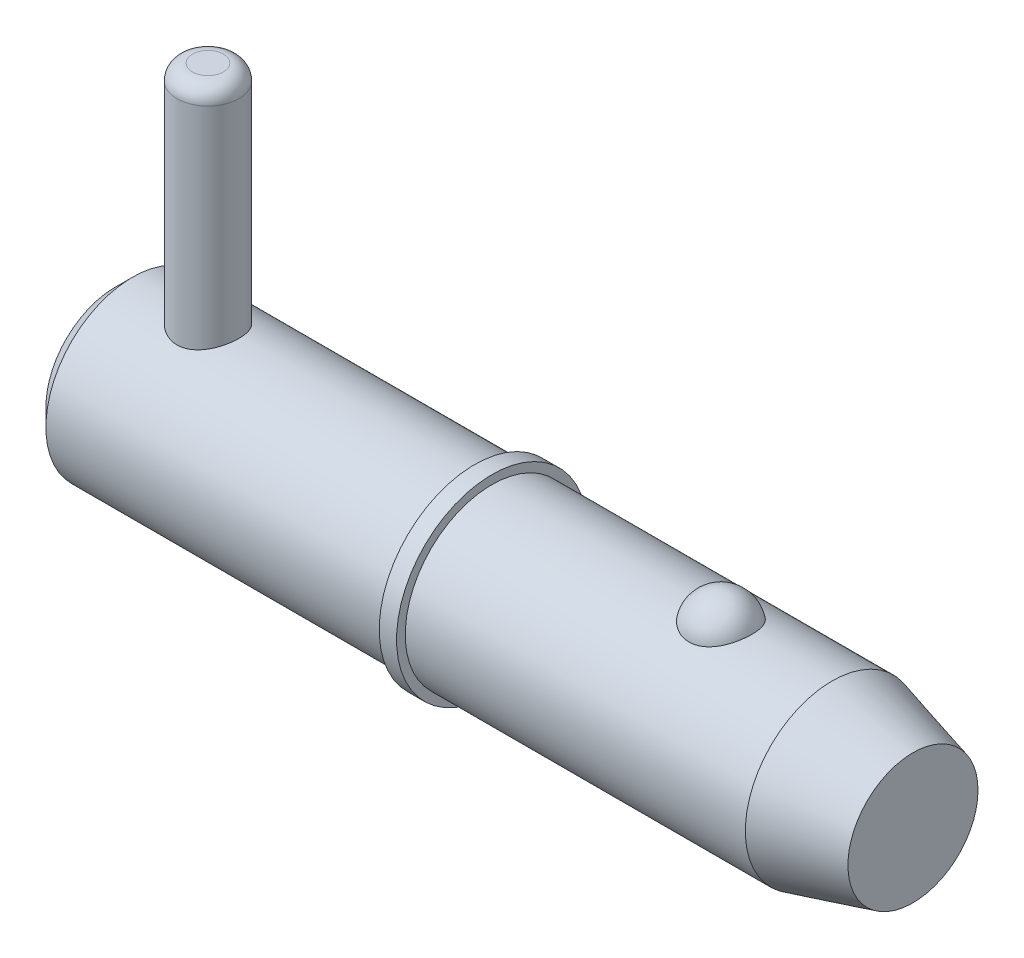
ISO-10303-21;
HEADER;
FILE_DESCRIPTION(('STEP AP214'),'2;1');
FILE_NAME('part.step','',(''),(''),'','','');
FILE_SCHEMA(('AUTOMOTIVE_DESIGN { 1 0 10303 214 1 1 1 1 }'));
ENDSEC;
DATA;
#1=APPLICATION_CONTEXT('core data for automotive mechanical design processes');
#2=APPLICATION_PROTOCOL_DEFINITION('international standard','automotive_design',2000,#1);
#3=PRODUCT_CONTEXT('',#1,'mechanical');
#4=PRODUCT('Part','Part','',(#3));
#5=PRODUCT_RELATED_PRODUCT_CATEGORY('part','',(#4));
#6=PRODUCT_DEFINITION_FORMATION('','',#4);
#7=PRODUCT_DEFINITION_CONTEXT('part definition',#1,'design');
#8=PRODUCT_DEFINITION('design','',#6,#7);
#9=PRODUCT_DEFINITION_SHAPE('','',#8);
#10=(LENGTH_UNIT() NAMED_UNIT(*) SI_UNIT(.MILLI.,.METRE.));
#11=(NAMED_UNIT(*) PLANE_ANGLE_UNIT() SI_UNIT($,.RADIAN.));
#12=(NAMED_UNIT(*) SI_UNIT($,.STERADIAN.) SOLID_ANGLE_UNIT());
#13=UNCERTAINTY_MEASURE_WITH_UNIT(LENGTH_MEASURE(1.E-05),#10,'distance_accuracy_value','');
#14=(GEOMETRIC_REPRESENTATION_CONTEXT(3) GLOBAL_UNCERTAINTY_ASSIGNED_CONTEXT((#13)) GLOBAL_UNIT_ASSIGNED_CONTEXT((#10,
#11,#12)) REPRESENTATION_CONTEXT('',''));
#15=CARTESIAN_POINT('',(0.,0.,0.));
#16=DIRECTION('',(0.,0.,1.));
#17=DIRECTION('',(1.,0.,0.));
#18=AXIS2_PLACEMENT_3D('',#15,#16,#17);
#19=CARTESIAN_POINT('',(5.94,19.845,0.));
#20=DIRECTION('',(0.,-1.,0.));
#21=DIRECTION('',(0.,0.,-1.));
#22=AXIS2_PLACEMENT_3D('',#19,#20,#21);
#23=CYLINDRICAL_SURFACE('',#22,1.98);
#24=CARTESIAN_POINT('',(5.94,-4.565,0.));
#25=DIRECTION('',(0.,1.,0.));
#26=DIRECTION('',(0.,0.,1.));
#27=AXIS2_PLACEMENT_3D('',#24,#25,#26);
#28=CIRCLE('',#27,1.98);
#29=CARTESIAN_POINT('',(5.94,-4.565,1.98));
#30=VERTEX_POINT('',#29);
#31=EDGE_CURVE('P0_E25',#30,#30,#28,.T.);
#32=ORIENTED_EDGE('',*,*,#31,.T.);
#33=EDGE_LOOP('',(#32));
#34=FACE_BOUND('',#33,.T.);
#35=CARTESIAN_POINT('',(5.94,18.855,0.));
#36=DIRECTION('',(0.,1.,0.));
#37=DIRECTION('',(0.,0.,1.));
#38=AXIS2_PLACEMENT_3D('',#35,#36,#37);
#39=CIRCLE('',#38,1.98);
#40=CARTESIAN_POINT('',(5.94,18.855,1.98));
#41=VERTEX_POINT('',#40);
#42=EDGE_CURVE('P0_E29',#41,#41,#39,.F.);
#43=ORIENTED_EDGE('',*,*,#42,.T.);
#44=EDGE_LOOP('',(#43));
#45=FACE_BOUND('',#44,.T.);
#46=ADVANCED_FACE('P0_F14',(#34,#45),#23,.T.);
#47=CARTESIAN_POINT('',(5.94,19.845,0.));
#48=DIRECTION('',(0.,1.,0.));
#49=DIRECTION('',(0.,0.,1.));
#50=AXIS2_PLACEMENT_3D('',#47,#48,#49);
#51=PLANE('',#50);
#52=CARTESIAN_POINT('',(5.94,19.845,0.));
#53=DIRECTION('',(0.,1.,0.));
#54=DIRECTION('',(0.,0.,1.));
#55=AXIS2_PLACEMENT_3D('',#52,#53,#54);
#56=CIRCLE('',#55,0.99);
#57=CARTESIAN_POINT('',(5.94,19.845,0.99));
#58=VERTEX_POINT('',#57);
#59=EDGE_CURVE('P0_E10',#58,#58,#56,.T.);
#60=ORIENTED_EDGE('',*,*,#59,.T.);
#61=EDGE_LOOP('',(#60));
#62=FACE_BOUND('',#61,.T.);
#63=ADVANCED_FACE('P0_F46',(#62),#51,.T.);
#64=CARTESIAN_POINT('',(5.94,-5.555,0.));
#65=DIRECTION('',(0.,1.,0.));
#66=DIRECTION('',(0.,0.,1.));
#67=AXIS2_PLACEMENT_3D('',#64,#65,#66);
#68=PLANE('',#67);
#69=CARTESIAN_POINT('',(5.94,-5.555,0.));
#70=DIRECTION('',(0.,1.,0.));
#71=DIRECTION('',(0.,0.,1.));
#72=AXIS2_PLACEMENT_3D('',#69,#70,#71);
#73=CIRCLE('',#72,0.99);
#74=CARTESIAN_POINT('',(5.94,-5.555,0.99));
#75=VERTEX_POINT('',#74);
#76=EDGE_CURVE('P0_E21',#75,#75,#73,.F.);
#77=ORIENTED_EDGE('',*,*,#76,.T.);
#78=EDGE_LOOP('',(#77));
#79=FACE_BOUND('',#78,.T.);
#80=ADVANCED_FACE('P0_F43',(#79),#68,.F.);
#81=CARTESIAN_POINT('',(5.94,-4.565,0.));
#82=DIRECTION('',(0.,1.,0.));
#83=DIRECTION('',(0.,0.,1.));
#84=AXIS2_PLACEMENT_3D('',#81,#82,#83);
#85=DEGENERATE_TOROIDAL_SURFACE('',#84,0.99,0.99,.T.);
#86=ORIENTED_EDGE('',*,*,#76,.F.);
#87=EDGE_LOOP('',(#86));
#88=FACE_BOUND('',#87,.T.);
#89=ORIENTED_EDGE('',*,*,#31,.F.);
#90=EDGE_LOOP('',(#89));
#91=FACE_BOUND('',#90,.T.);
#92=ADVANCED_FACE('P0_F38',(#88,#91),#85,.T.);
#93=CARTESIAN_POINT('',(5.94,18.855,0.));
#94=DIRECTION('',(0.,1.,0.));
#95=DIRECTION('',(0.,0.,1.));
#96=AXIS2_PLACEMENT_3D('',#93,#94,#95);
#97=DEGENERATE_TOROIDAL_SURFACE('',#96,0.99,0.99,.T.);
#98=ORIENTED_EDGE('',*,*,#42,.F.);
#99=EDGE_LOOP('',(#98));
#100=FACE_BOUND('',#99,.T.);
#101=ORIENTED_EDGE('',*,*,#59,.F.);
#102=EDGE_LOOP('',(#101));
#103=FACE_BOUND('',#102,.T.);
#104=ADVANCED_FACE('P0_F16',(#100,#103),#97,.T.);
#105=CLOSED_SHELL('',(#46,#63,#80,#92,#104));
#106=MANIFOLD_SOLID_BREP('P0_B1',#105);
#107=CARTESIAN_POINT('',(0.,0.,0.));
#108=DIRECTION('',(1.,0.,0.));
#109=DIRECTION('',(0.,0.,-1.));
#110=AXIS2_PLACEMENT_3D('',#107,#108,#109);
#111=CYLINDRICAL_SURFACE('',#110,5.555);
#112=CARTESIAN_POINT('',(45.9171144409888,0.,0.));
#113=DIRECTION('',(1.,0.,0.));
#114=DIRECTION('',(0.,0.,-1.));
#115=AXIS2_PLACEMENT_3D('',#112,#113,#114);
#116=CIRCLE('',#115,5.555);
#117=CARTESIAN_POINT('',(45.9171144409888,0.,-5.555));
#118=VERTEX_POINT('',#117);
#119=EDGE_CURVE('P1_E81',#118,#118,#116,.T.);
#120=ORIENTED_EDGE('',*,*,#119,.F.);
#121=EDGE_LOOP('',(#120));
#122=FACE_BOUND('',#121,.T.);
#123=CARTESIAN_POINT('',(24.13,0.,0.));
#124=DIRECTION('',(1.,0.,0.));
#125=DIRECTION('',(0.,0.,-1.));
#126=AXIS2_PLACEMENT_3D('',#123,#124,#125);
#127=CIRCLE('',#126,5.555);
#128=CARTESIAN_POINT('',(24.13,0.,-5.555));
#129=VERTEX_POINT('',#128);
#130=EDGE_CURVE('P1_E85',#129,#129,#127,.T.);
#131=ORIENTED_EDGE('',*,*,#130,.T.);
#132=EDGE_LOOP('',(#131));
#133=FACE_BOUND('',#132,.T.);
#134=CARTESIAN_POINT('',(38.7986264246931,5.16741224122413,2.03859650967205));
#135=CARTESIAN_POINT('',(38.6929492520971,5.16740893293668,2.03859990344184));
#136=CARTESIAN_POINT('',(38.58729894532,5.17079470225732,2.03008306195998));
#137=CARTESIAN_POINT('',(38.3791419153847,5.18392795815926,1.9963072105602));
#138=CARTESIAN_POINT('',(38.2766344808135,5.19367399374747,1.9710520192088));
#139=CARTESIAN_POINT('',(38.0777710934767,5.21839168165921,1.90463997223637));
#140=CARTESIAN_POINT('',(37.9814064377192,5.23335573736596,1.86350622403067));
#141=CARTESIAN_POINT('',(37.7970804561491,5.26688076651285,1.76652592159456));
#142=CARTESIAN_POINT('',(37.7091207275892,5.28544242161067,1.71067657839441));
#143=CARTESIAN_POINT('',(37.5412654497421,5.32479845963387,1.58399959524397));
#144=CARTESIAN_POINT('',(37.4616656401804,5.34564089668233,1.51279545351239));
#145=CARTESIAN_POINT('',(37.3151290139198,5.38697258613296,1.35828584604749));
#146=CARTESIAN_POINT('',(37.248194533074,5.40746177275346,1.27497815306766));
#147=CARTESIAN_POINT('',(37.1256103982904,5.44694508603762,1.09440293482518));
#148=CARTESIAN_POINT('',(37.0705989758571,5.46583143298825,0.99667783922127));
#149=CARTESIAN_POINT('',(36.9769376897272,5.49908030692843,0.792961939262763));
#150=CARTESIAN_POINT('',(36.9382894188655,5.513442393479,0.686970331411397));
#151=CARTESIAN_POINT('',(36.8776807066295,5.536358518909,0.468019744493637));
#152=CARTESIAN_POINT('',(36.8559725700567,5.54482455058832,0.35498154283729));
#153=CARTESIAN_POINT('',(36.8306362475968,5.55473324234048,0.126595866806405));
#154=CARTESIAN_POINT('',(36.8270077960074,5.55617600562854,0.0112484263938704));
#155=CARTESIAN_POINT('',(36.8378817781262,5.55189984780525,-0.21801161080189));
#156=CARTESIAN_POINT('',(36.8523151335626,5.54620821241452,-0.331928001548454));
#157=CARTESIAN_POINT('',(36.898903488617,5.52828920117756,-0.555544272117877));
#158=CARTESIAN_POINT('',(36.9310588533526,5.5160616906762,-0.665244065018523));
#159=CARTESIAN_POINT('',(37.0124883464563,5.48630779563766,-0.877469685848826));
#160=CARTESIAN_POINT('',(37.0617816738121,5.4687754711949,-0.979987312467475));
#161=CARTESIAN_POINT('',(37.1764785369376,5.43024700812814,-1.1748697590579));
#162=CARTESIAN_POINT('',(37.2418831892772,5.4092506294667,-1.26723387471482));
#163=CARTESIAN_POINT('',(37.3875712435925,5.36600927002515,-1.4394013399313));
#164=CARTESIAN_POINT('',(37.4678859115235,5.34376173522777,-1.51917763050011));
#165=CARTESIAN_POINT('',(37.6414520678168,5.30057971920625,-1.6636033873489));
#166=CARTESIAN_POINT('',(37.734702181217,5.27964509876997,-1.72825445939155));
#167=CARTESIAN_POINT('',(37.9293939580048,5.24205250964,-1.8390947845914));
#168=CARTESIAN_POINT('',(38.0305900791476,5.22530519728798,-1.88568407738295));
#169=CARTESIAN_POINT('',(38.2401552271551,5.19750919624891,-1.96100802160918));
#170=CARTESIAN_POINT('',(38.3485215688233,5.1864583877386,-1.98974931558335));
#171=CARTESIAN_POINT('',(38.5634989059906,5.17184410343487,-2.02742262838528));
#172=CARTESIAN_POINT('',(38.669925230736,5.16793282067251,-2.0372760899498));
#173=CARTESIAN_POINT('',(38.8829925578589,5.1669899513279,-2.03966777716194));
#174=CARTESIAN_POINT('',(38.9896335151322,5.16995704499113,-2.03220932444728));
#175=CARTESIAN_POINT('',(39.1967730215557,5.18222383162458,-2.0007117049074));
#176=CARTESIAN_POINT('',(39.2973599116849,5.19133213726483,-1.97717337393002));
#177=CARTESIAN_POINT('',(39.4930141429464,5.21467637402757,-1.91475248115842));
#178=CARTESIAN_POINT('',(39.5880810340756,5.22891272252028,-1.87586867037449));
#179=CARTESIAN_POINT('',(39.7723711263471,5.26137066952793,-1.78282713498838));
#180=CARTESIAN_POINT('',(39.8614190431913,5.27967329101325,-1.7283512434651));
#181=CARTESIAN_POINT('',(40.0292880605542,5.31817411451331,-1.60597483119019));
#182=CARTESIAN_POINT('',(40.1081068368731,5.33837274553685,-1.53807126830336));
#183=CARTESIAN_POINT('',(40.2575156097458,5.37968287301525,-1.38688970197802));
#184=CARTESIAN_POINT('',(40.3275058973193,5.40079011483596,-1.30301744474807));
#185=CARTESIAN_POINT('',(40.4530125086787,5.44074401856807,-1.12458170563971));
#186=CARTESIAN_POINT('',(40.5085262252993,5.4595902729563,-1.03001630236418));
#187=CARTESIAN_POINT('',(40.6055507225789,5.49369849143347,-0.829439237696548));
#188=CARTESIAN_POINT('',(40.6465483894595,5.50882422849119,-0.723155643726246));
#189=CARTESIAN_POINT('',(40.7111250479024,5.53310911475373,-0.50477271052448));
#190=CARTESIAN_POINT('',(40.7347036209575,5.54226812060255,-0.3926732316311));
#191=CARTESIAN_POINT('',(40.764013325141,5.55370358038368,-0.165459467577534));
#192=CARTESIAN_POINT('',(40.7696884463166,5.55595843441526,-0.0503368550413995));
#193=CARTESIAN_POINT('',(40.762916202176,5.55329317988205,0.179288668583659));
#194=CARTESIAN_POINT('',(40.7504690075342,5.54837313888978,0.293791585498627));
#195=CARTESIAN_POINT('',(40.7077798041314,5.53189037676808,0.518526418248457));
#196=CARTESIAN_POINT('',(40.677598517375,5.5203503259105,0.628771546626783));
#197=CARTESIAN_POINT('',(40.6000962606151,5.49182453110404,0.842318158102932));
#198=CARTESIAN_POINT('',(40.5527743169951,5.47483847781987,0.945619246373));
#199=CARTESIAN_POINT('',(40.4417204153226,5.43710633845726,1.14281571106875));
#200=CARTESIAN_POINT('',(40.3779215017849,5.41634501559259,1.23667048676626));
#201=CARTESIAN_POINT('',(40.2353577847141,5.37334572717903,1.4118524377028));
#202=CARTESIAN_POINT('',(40.1565932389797,5.35110778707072,1.49317982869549));
#203=CARTESIAN_POINT('',(39.9864234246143,5.30779474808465,1.64049162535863));
#204=CARTESIAN_POINT('',(39.8951002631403,5.28671324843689,1.7065687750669));
#205=CARTESIAN_POINT('',(39.7017390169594,5.24804852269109,1.82201372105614));
#206=CARTESIAN_POINT('',(39.5997005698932,5.23046541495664,1.87138095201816));
#207=CARTESIAN_POINT('',(39.3836187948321,5.20042692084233,1.95335298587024));
#208=CARTESIAN_POINT('',(39.269260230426,5.18820192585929,1.98521734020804));
#209=CARTESIAN_POINT('',(39.0361307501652,5.17169804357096,2.02783294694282));
#210=CARTESIAN_POINT('',(38.9173616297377,5.16741595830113,2.03859269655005));
#211=CARTESIAN_POINT('',(38.7986264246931,5.16741224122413,2.03859650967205));
#212=B_SPLINE_CURVE_WITH_KNOTS('',3,(#134,#135,#136,#137,#138,#139,#140,#141,#142,#143,#144,
#145,#146,#147,#148,#149,#150,#151,#152,#153,#154,#155,#156,#157,#158,#159,#160,#161,#162,#163,
#164,#165,#166,#167,#168,#169,#170,#171,#172,#173,#174,#175,#176,#177,#178,#179,#180,#181,#182,
#183,#184,#185,#186,#187,#188,#189,#190,#191,#192,#193,#194,#195,#196,#197,#198,#199,#200,#201,
#202,#203,#204,#205,#206,#207,#208,#209,#210,#211),.UNSPECIFIED.,.T.,.F.,(4,2,2,2,2,2,2,2,2,2,2,
2,2,2,2,2,2,2,2,2,2,2,2,2,2,2,2,2,2,2,2,2,2,2,2,2,2,2,4),(0.,0.316595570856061,
0.633118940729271,0.949183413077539,1.26530783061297,1.59030762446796,1.91536729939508,
2.25495824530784,2.59458224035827,2.93917283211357,3.28375835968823,3.62703002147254,
3.97030875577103,4.31397329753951,4.65766166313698,5.00207904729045,5.34645984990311,
5.6827054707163,6.01882587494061,6.33808403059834,6.65728093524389,6.9669637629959,
7.27667180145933,7.59321535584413,7.90983070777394,8.24210387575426,8.57443684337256,
8.91755896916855,9.26068933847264,9.60489211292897,9.94909164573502,10.2921194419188,
10.6351667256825,10.9796305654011,11.324088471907,11.666392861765,12.0087088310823,
12.3645679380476,12.7202837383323),.UNSPECIFIED.);
#213=CARTESIAN_POINT('',(38.7986264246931,5.16741224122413,2.03859650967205));
#214=VERTEX_POINT('',#213);
#215=EDGE_CURVE('P1_E35',#214,#214,#212,.T.);
#216=ORIENTED_EDGE('',*,*,#215,.T.);
#217=EDGE_LOOP('',(#216));
#218=FACE_BOUND('',#217,.T.);
#219=ADVANCED_FACE('P1_F13',(#122,#133,#218),#111,.T.);
#220=CARTESIAN_POINT('',(0.,0.,0.));
#221=DIRECTION('',(-1.,0.,0.));
#222=DIRECTION('',(0.,0.,1.));
#223=AXIS2_PLACEMENT_3D('',#220,#221,#222);
#224=PLANE('',#223);
#225=CARTESIAN_POINT('',(0.,0.,0.));
#226=DIRECTION('',(1.,0.,0.));
#227=DIRECTION('',(0.,0.,-1.));
#228=AXIS2_PLACEMENT_3D('',#225,#226,#227);
#229=CIRCLE('',#228,4.444);
#230=CARTESIAN_POINT('',(0.,0.,-4.444));
#231=VERTEX_POINT('',#230);
#232=EDGE_CURVE('P1_E9',#231,#231,#229,.T.);
#233=ORIENTED_EDGE('',*,*,#232,.F.);
#234=EDGE_LOOP('',(#233));
#235=FACE_BOUND('',#234,.T.);
#236=ADVANCED_FACE('P1_F15',(#235),#224,.T.);
#237=CARTESIAN_POINT('',(1.111,0.,0.));
#238=DIRECTION('',(1.,0.,0.));
#239=DIRECTION('',(0.,0.,-1.));
#240=AXIS2_PLACEMENT_3D('',#237,#238,#239);
#241=CONICAL_SURFACE('',#240,5.555,0.78539816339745);
#242=ORIENTED_EDGE('',*,*,#232,.T.);
#243=EDGE_LOOP('',(#242));
#244=FACE_BOUND('',#243,.T.);
#245=CARTESIAN_POINT('',(1.111,0.,0.));
#246=DIRECTION('',(1.,0.,0.));
#247=DIRECTION('',(0.,0.,-1.));
#248=AXIS2_PLACEMENT_3D('',#245,#246,#247);
#249=CIRCLE('',#248,5.555);
#250=CARTESIAN_POINT('',(1.111,0.,-5.555));
#251=VERTEX_POINT('',#250);
#252=EDGE_CURVE('P1_E26',#251,#251,#249,.T.);
#253=ORIENTED_EDGE('',*,*,#252,.F.);
#254=EDGE_LOOP('',(#253));
#255=FACE_BOUND('',#254,.T.);
#256=ADVANCED_FACE('P1_F77',(#244,#255),#241,.T.);
#257=CARTESIAN_POINT('',(0.,0.,0.));
#258=DIRECTION('',(1.,0.,0.));
#259=DIRECTION('',(0.,0.,-1.));
#260=AXIS2_PLACEMENT_3D('',#257,#258,#259);
#261=CYLINDRICAL_SURFACE('',#260,5.555);
#262=CARTESIAN_POINT('',(5.94,-5.19014691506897,1.98));
#263=CARTESIAN_POINT('',(5.83264687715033,-5.19014494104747,1.98000226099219));
#264=CARTESIAN_POINT('',(5.7253094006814,-5.19351395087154,1.97123988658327));
#265=CARTESIAN_POINT('',(5.51384517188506,-5.20654291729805,1.93656219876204));
#266=CARTESIAN_POINT('',(5.40971858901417,-5.21620320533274,1.91064598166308));
#267=CARTESIAN_POINT('',(5.20778082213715,-5.24058443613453,1.84271148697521));
#268=CARTESIAN_POINT('',(5.10995634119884,-5.25529427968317,1.80072850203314));
#269=CARTESIAN_POINT('',(4.92270352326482,-5.28810012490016,1.70197537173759));
#270=CARTESIAN_POINT('',(4.83327743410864,-5.3061970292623,1.64520128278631));
#271=CARTESIAN_POINT('',(4.66135184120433,-5.34464714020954,1.51575187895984));
#272=CARTESIAN_POINT('',(4.57928277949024,-5.36506222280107,1.44252311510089));
#273=CARTESIAN_POINT('',(4.42829115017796,-5.40532920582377,1.28342047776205));
#274=CARTESIAN_POINT('',(4.35937105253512,-5.42518099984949,1.19754423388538));
#275=CARTESIAN_POINT('',(4.23461605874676,-5.46281133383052,1.01237205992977));
#276=CARTESIAN_POINT('',(4.17924129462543,-5.48050875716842,0.912748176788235));
#277=CARTESIAN_POINT('',(4.0862117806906,-5.51109938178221,0.70485824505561));
#278=CARTESIAN_POINT('',(4.0485515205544,-5.52399407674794,0.596594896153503));
#279=CARTESIAN_POINT('',(3.99350662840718,-5.54308759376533,0.379019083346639));
#280=CARTESIAN_POINT('',(3.97538263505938,-5.54952987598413,0.269915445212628));
#281=CARTESIAN_POINT('',(3.95756405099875,-5.55586205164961,0.0500378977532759));
#282=CARTESIAN_POINT('',(3.95786404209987,-5.55575387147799,-0.060735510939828));
#283=CARTESIAN_POINT('',(3.97643665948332,-5.54915684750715,-0.275539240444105));
#284=CARTESIAN_POINT('',(3.99390415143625,-5.54295384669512,-0.379649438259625));
#285=CARTESIAN_POINT('',(4.0449721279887,-5.52523170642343,-0.583350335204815));
#286=CARTESIAN_POINT('',(4.07857373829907,-5.51371219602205,-0.682940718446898));
#287=CARTESIAN_POINT('',(4.16137312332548,-5.4863099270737,-0.876423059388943));
#288=CARTESIAN_POINT('',(4.2107826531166,-5.47036834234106,-0.970215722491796));
#289=CARTESIAN_POINT('',(4.32361427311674,-5.43575653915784,-1.1484017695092));
#290=CARTESIAN_POINT('',(4.38704062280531,-5.41708549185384,-1.23279228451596));
#291=CARTESIAN_POINT('',(4.53006791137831,-5.37778429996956,-1.39454579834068));
#292=CARTESIAN_POINT('',(4.61035105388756,-5.35710277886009,-1.4712940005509));
#293=CARTESIAN_POINT('',(4.78279835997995,-5.31692766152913,-1.6104545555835));
#294=CARTESIAN_POINT('',(4.874964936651,-5.29743430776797,-1.67286398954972));
#295=CARTESIAN_POINT('',(5.07076688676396,-5.26153775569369,-1.78259698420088));
#296=CARTESIAN_POINT('',(5.17458163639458,-5.24519780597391,-1.8296227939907));
#297=CARTESIAN_POINT('',(5.38938990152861,-5.21818744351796,-1.90530278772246));
#298=CARTESIAN_POINT('',(5.50037985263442,-5.20751423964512,-1.93396601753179));
#299=CARTESIAN_POINT('',(5.72036376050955,-5.19369176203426,-1.97077654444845));
#300=CARTESIAN_POINT('',(5.82917370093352,-5.19018851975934,-1.97989015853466));
#301=CARTESIAN_POINT('',(6.04680100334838,-5.19010609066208,-1.98010779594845));
#302=CARTESIAN_POINT('',(6.15561835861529,-5.19352540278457,-1.97121572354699));
#303=CARTESIAN_POINT('',(6.36548036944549,-5.20654623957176,-1.93654727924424));
#304=CARTESIAN_POINT('',(6.46666051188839,-5.21588705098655,-1.91148218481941));
#305=CARTESIAN_POINT('',(6.66334537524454,-5.23939939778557,-1.84605494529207));
#306=CARTESIAN_POINT('',(6.75884899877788,-5.25357186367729,-1.8056898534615));
#307=CARTESIAN_POINT('',(6.94517989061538,-5.28576258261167,-1.70921153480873));
#308=CARTESIAN_POINT('',(7.03572661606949,-5.30389804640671,-1.65259670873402));
#309=CARTESIAN_POINT('',(7.20638087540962,-5.34176077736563,-1.52577523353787));
#310=CARTESIAN_POINT('',(7.28648490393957,-5.36148857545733,-1.45556404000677));
#311=CARTESIAN_POINT('',(7.43864697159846,-5.40165494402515,-1.2988614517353));
#312=CARTESIAN_POINT('',(7.50999887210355,-5.42207106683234,-1.21167640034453));
#313=CARTESIAN_POINT('',(7.63712639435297,-5.46023601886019,-1.026066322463));
#314=CARTESIAN_POINT('',(7.69290228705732,-5.47798489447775,-0.927641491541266));
#315=CARTESIAN_POINT('',(7.78684673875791,-5.50876590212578,-0.722633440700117));
#316=CARTESIAN_POINT('',(7.82510508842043,-5.52182201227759,-0.616095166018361));
#317=CARTESIAN_POINT('',(7.88297051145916,-5.54184206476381,-0.397530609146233));
#318=CARTESIAN_POINT('',(7.90258540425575,-5.5488085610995,-0.285506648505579));
#319=CARTESIAN_POINT('',(7.9218262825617,-5.55564472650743,-0.065566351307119));
#320=CARTESIAN_POINT('',(7.92245987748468,-5.55587212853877,0.0422515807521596));
#321=CARTESIAN_POINT('',(7.90626329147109,-5.55011340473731,0.256387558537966));
#322=CARTESIAN_POINT('',(7.88943488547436,-5.54412791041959,0.362705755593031));
#323=CARTESIAN_POINT('',(7.83948457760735,-5.52676548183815,0.568649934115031));
#324=CARTESIAN_POINT('',(7.8067003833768,-5.51550046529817,0.668367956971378));
#325=CARTESIAN_POINT('',(7.72609369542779,-5.48874437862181,0.860911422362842));
#326=CARTESIAN_POINT('',(7.67826838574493,-5.47325251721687,0.953735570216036));
#327=CARTESIAN_POINT('',(7.56675024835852,-5.43884382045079,1.13391068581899));
#328=CARTESIAN_POINT('',(7.50249968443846,-5.41981485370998,1.22089468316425));
#329=CARTESIAN_POINT('',(7.36086495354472,-5.38069275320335,1.38316665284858));
#330=CARTESIAN_POINT('',(7.28347630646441,-5.36059925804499,1.45845061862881));
#331=CARTESIAN_POINT('',(7.11347587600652,-5.32048380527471,1.59876646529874));
#332=CARTESIAN_POINT('',(7.02032386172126,-5.30050854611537,1.66315951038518));
#333=CARTESIAN_POINT('',(6.82388804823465,-5.26398994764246,1.77536801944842));
#334=CARTESIAN_POINT('',(6.7206049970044,-5.24744635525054,1.82318470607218));
#335=CARTESIAN_POINT('',(6.50639706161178,-5.21987969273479,1.90068230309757));
#336=CARTESIAN_POINT('',(6.3954529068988,-5.20887116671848,1.93031547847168));
#337=CARTESIAN_POINT('',(6.16966522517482,-5.19400760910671,1.96996824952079));
#338=CARTESIAN_POINT('',(6.05482366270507,-5.19014902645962,1.97999758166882));
#339=CARTESIAN_POINT('',(5.94,-5.19014691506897,1.98));
#340=B_SPLINE_CURVE_WITH_KNOTS('',3,(#262,#263,#264,#265,#266,#267,#268,#269,#270,#271,#272,
#273,#274,#275,#276,#277,#278,#279,#280,#281,#282,#283,#284,#285,#286,#287,#288,#289,#290,#291,
#292,#293,#294,#295,#296,#297,#298,#299,#300,#301,#302,#303,#304,#305,#306,#307,#308,#309,#310,
#311,#312,#313,#314,#315,#316,#317,#318,#319,#320,#321,#322,#323,#324,#325,#326,#327,#328,#329,
#330,#331,#332,#333,#334,#335,#336,#337,#338,#339),.UNSPECIFIED.,.T.,.F.,(4,2,2,2,2,2,2,2,2,2,2,
2,2,2,2,2,2,2,2,2,2,2,2,2,2,2,2,2,2,2,2,2,2,2,2,2,2,2,4),(0.,0.321632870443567,
0.643282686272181,0.964229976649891,1.28526292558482,1.61937087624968,1.9535415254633,
2.29784481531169,2.64204093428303,2.97269632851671,3.30325448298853,3.61901541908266,
3.93479838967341,4.25500220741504,4.57530346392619,4.91268648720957,5.25013812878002,
5.59378026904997,5.93725299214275,6.26331481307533,6.58930593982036,6.90185604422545,
7.21446637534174,7.53801472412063,7.86167140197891,8.20353561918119,8.54539388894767,
8.88547970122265,9.22542281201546,9.54728637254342,9.86911722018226,10.1844146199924,
10.4997710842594,10.827730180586,11.1558013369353,11.499115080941,11.8424034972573,
12.1865892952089,12.5306041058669),.UNSPECIFIED.);
#341=CARTESIAN_POINT('',(5.94,-5.19014691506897,1.98));
#342=VERTEX_POINT('',#341);
#343=EDGE_CURVE('P1_E17',#342,#342,#340,.T.);
#344=ORIENTED_EDGE('',*,*,#343,.F.);
#345=EDGE_LOOP('',(#344));
#346=FACE_BOUND('',#345,.T.);
#347=CARTESIAN_POINT('',(5.94,5.19014691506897,1.98));
#348=CARTESIAN_POINT('',(6.04735312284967,5.19014494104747,1.98000226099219));
#349=CARTESIAN_POINT('',(6.1546905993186,5.19351395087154,1.97123988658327));
#350=CARTESIAN_POINT('',(6.36615482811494,5.20654291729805,1.93656219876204));
#351=CARTESIAN_POINT('',(6.47028141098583,5.21620320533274,1.91064598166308));
#352=CARTESIAN_POINT('',(6.67221917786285,5.24058443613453,1.84271148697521));
#353=CARTESIAN_POINT('',(6.77004365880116,5.25529427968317,1.80072850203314));
#354=CARTESIAN_POINT('',(6.95729647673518,5.28810012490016,1.70197537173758));
#355=CARTESIAN_POINT('',(7.04672256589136,5.3061970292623,1.64520128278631));
#356=CARTESIAN_POINT('',(7.21864815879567,5.34464714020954,1.51575187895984));
#357=CARTESIAN_POINT('',(7.30071722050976,5.36506222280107,1.44252311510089));
#358=CARTESIAN_POINT('',(7.45170884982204,5.40532920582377,1.28342047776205));
#359=CARTESIAN_POINT('',(7.52062894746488,5.42518099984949,1.19754423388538));
#360=CARTESIAN_POINT('',(7.64538394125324,5.46281133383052,1.01237205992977));
#361=CARTESIAN_POINT('',(7.70075870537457,5.48050875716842,0.912748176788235));
#362=CARTESIAN_POINT('',(7.7937882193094,5.51109938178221,0.704858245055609));
#363=CARTESIAN_POINT('',(7.8314484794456,5.52399407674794,0.596594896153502));
#364=CARTESIAN_POINT('',(7.88649337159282,5.54308759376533,0.379019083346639));
#365=CARTESIAN_POINT('',(7.90461736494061,5.54952987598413,0.269915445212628));
#366=CARTESIAN_POINT('',(7.92243594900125,5.55586205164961,0.0500378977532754));
#367=CARTESIAN_POINT('',(7.92213595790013,5.55575387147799,-0.0607355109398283));
#368=CARTESIAN_POINT('',(7.90356334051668,5.54915684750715,-0.275539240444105));
#369=CARTESIAN_POINT('',(7.88609584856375,5.54295384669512,-0.379649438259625));
#370=CARTESIAN_POINT('',(7.8350278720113,5.52523170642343,-0.583350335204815));
#371=CARTESIAN_POINT('',(7.80142626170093,5.51371219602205,-0.682940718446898));
#372=CARTESIAN_POINT('',(7.71862687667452,5.4863099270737,-0.876423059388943));
#373=CARTESIAN_POINT('',(7.6692173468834,5.47036834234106,-0.970215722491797));
#374=CARTESIAN_POINT('',(7.55638572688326,5.43575653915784,-1.1484017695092));
#375=CARTESIAN_POINT('',(7.49295937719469,5.41708549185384,-1.23279228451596));
#376=CARTESIAN_POINT('',(7.34993208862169,5.37778429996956,-1.39454579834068));
#377=CARTESIAN_POINT('',(7.26964894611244,5.35710277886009,-1.4712940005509));
#378=CARTESIAN_POINT('',(7.09720164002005,5.31692766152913,-1.6104545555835));
#379=CARTESIAN_POINT('',(7.00503506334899,5.29743430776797,-1.67286398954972));
#380=CARTESIAN_POINT('',(6.80923311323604,5.26153775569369,-1.78259698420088));
#381=CARTESIAN_POINT('',(6.70541836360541,5.24519780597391,-1.8296227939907));
#382=CARTESIAN_POINT('',(6.49061009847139,5.21818744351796,-1.90530278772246));
#383=CARTESIAN_POINT('',(6.37962014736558,5.20751423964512,-1.93396601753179));
#384=CARTESIAN_POINT('',(6.15963623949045,5.19369176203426,-1.97077654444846));
#385=CARTESIAN_POINT('',(6.05082629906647,5.19018851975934,-1.97989015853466));
#386=CARTESIAN_POINT('',(5.83319899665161,5.19010609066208,-1.98010779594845));
#387=CARTESIAN_POINT('',(5.7243816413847,5.19352540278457,-1.97121572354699));
#388=CARTESIAN_POINT('',(5.5145196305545,5.20654623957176,-1.93654727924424));
#389=CARTESIAN_POINT('',(5.4133394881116,5.21588705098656,-1.91148218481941));
#390=CARTESIAN_POINT('',(5.21665462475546,5.23939939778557,-1.84605494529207));
#391=CARTESIAN_POINT('',(5.12115100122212,5.25357186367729,-1.8056898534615));
#392=CARTESIAN_POINT('',(4.93482010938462,5.28576258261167,-1.70921153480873));
#393=CARTESIAN_POINT('',(4.84427338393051,5.30389804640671,-1.65259670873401));
#394=CARTESIAN_POINT('',(4.67361912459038,5.34176077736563,-1.52577523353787));
#395=CARTESIAN_POINT('',(4.59351509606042,5.36148857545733,-1.45556404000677));
#396=CARTESIAN_POINT('',(4.44135302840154,5.40165494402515,-1.2988614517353));
#397=CARTESIAN_POINT('',(4.37000112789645,5.42207106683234,-1.21167640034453));
#398=CARTESIAN_POINT('',(4.24287360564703,5.46023601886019,-1.026066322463));
#399=CARTESIAN_POINT('',(4.18709771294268,5.47798489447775,-0.927641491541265));
#400=CARTESIAN_POINT('',(4.09315326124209,5.50876590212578,-0.722633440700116));
#401=CARTESIAN_POINT('',(4.05489491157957,5.52182201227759,-0.61609516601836));
#402=CARTESIAN_POINT('',(3.99702948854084,5.54184206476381,-0.397530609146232));
#403=CARTESIAN_POINT('',(3.97741459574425,5.5488085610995,-0.285506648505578));
#404=CARTESIAN_POINT('',(3.9581737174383,5.55564472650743,-0.0655663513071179));
#405=CARTESIAN_POINT('',(3.95754012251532,5.55587212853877,0.0422515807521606));
#406=CARTESIAN_POINT('',(3.97373670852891,5.55011340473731,0.256387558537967));
#407=CARTESIAN_POINT('',(3.99056511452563,5.54412791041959,0.362705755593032));
#408=CARTESIAN_POINT('',(4.04051542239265,5.52676548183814,0.568649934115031));
#409=CARTESIAN_POINT('',(4.07329961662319,5.51550046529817,0.668367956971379));
#410=CARTESIAN_POINT('',(4.15390630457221,5.48874437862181,0.860911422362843));
#411=CARTESIAN_POINT('',(4.20173161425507,5.47325251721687,0.953735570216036));
#412=CARTESIAN_POINT('',(4.31324975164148,5.43884382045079,1.13391068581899));
#413=CARTESIAN_POINT('',(4.37750031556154,5.41981485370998,1.22089468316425));
#414=CARTESIAN_POINT('',(4.51913504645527,5.38069275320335,1.38316665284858));
#415=CARTESIAN_POINT('',(4.59652369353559,5.36059925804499,1.45845061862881));
#416=CARTESIAN_POINT('',(4.76652412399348,5.32048380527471,1.59876646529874));
#417=CARTESIAN_POINT('',(4.85967613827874,5.30050854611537,1.66315951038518));
#418=CARTESIAN_POINT('',(5.05611195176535,5.26398994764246,1.77536801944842));
#419=CARTESIAN_POINT('',(5.1593950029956,5.24744635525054,1.82318470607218));
#420=CARTESIAN_POINT('',(5.37360293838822,5.21987969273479,1.90068230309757));
#421=CARTESIAN_POINT('',(5.4845470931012,5.20887116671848,1.93031547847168));
#422=CARTESIAN_POINT('',(5.71033477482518,5.19400760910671,1.96996824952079));
#423=CARTESIAN_POINT('',(5.82517633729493,5.19014902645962,1.97999758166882));
#424=CARTESIAN_POINT('',(5.94,5.19014691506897,1.98));
#425=B_SPLINE_CURVE_WITH_KNOTS('',3,(#347,#348,#349,#350,#351,#352,#353,#354,#355,#356,#357,
#358,#359,#360,#361,#362,#363,#364,#365,#366,#367,#368,#369,#370,#371,#372,#373,#374,#375,#376,
#377,#378,#379,#380,#381,#382,#383,#384,#385,#386,#387,#388,#389,#390,#391,#392,#393,#394,#395,
#396,#397,#398,#399,#400,#401,#402,#403,#404,#405,#406,#407,#408,#409,#410,#411,#412,#413,#414,
#415,#416,#417,#418,#419,#420,#421,#422,#423,#424),.UNSPECIFIED.,.T.,.F.,(4,2,2,2,2,2,2,2,2,2,2,
2,2,2,2,2,2,2,2,2,2,2,2,2,2,2,2,2,2,2,2,2,2,2,2,2,2,2,4),(0.,0.321632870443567,
0.643282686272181,0.964229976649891,1.28526292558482,1.61937087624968,1.9535415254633,
2.29784481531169,2.64204093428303,2.97269632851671,3.30325448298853,3.61901541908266,
3.93479838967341,4.25500220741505,4.57530346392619,4.91268648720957,5.25013812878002,
5.59378026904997,5.93725299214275,6.26331481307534,6.58930593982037,6.90185604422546,
7.21446637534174,7.53801472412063,7.86167140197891,8.20353561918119,8.54539388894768,
8.88547970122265,9.22542281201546,9.54728637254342,9.86911722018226,10.1844146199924,
10.4997710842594,10.827730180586,11.1558013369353,11.499115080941,11.8424034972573,
12.1865892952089,12.5306041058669),.UNSPECIFIED.);
#426=CARTESIAN_POINT('',(5.94,5.19014691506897,1.98));
#427=VERTEX_POINT('',#426);
#428=EDGE_CURVE('P1_E43',#427,#427,#425,.T.);
#429=ORIENTED_EDGE('',*,*,#428,.F.);
#430=EDGE_LOOP('',(#429));
#431=FACE_BOUND('',#430,.T.);
#432=ORIENTED_EDGE('',*,*,#252,.T.);
#433=EDGE_LOOP('',(#432));
#434=FACE_BOUND('',#433,.T.);
#435=CARTESIAN_POINT('',(23.019,0.,0.));
#436=DIRECTION('',(1.,0.,0.));
#437=DIRECTION('',(0.,0.,-1.));
#438=AXIS2_PLACEMENT_3D('',#435,#436,#437);
#439=CIRCLE('',#438,5.555);
#440=CARTESIAN_POINT('',(23.019,0.,-5.555));
#441=VERTEX_POINT('',#440);
#442=EDGE_CURVE('P1_E31',#441,#441,#439,.T.);
#443=ORIENTED_EDGE('',*,*,#442,.F.);
#444=EDGE_LOOP('',(#443));
#445=FACE_BOUND('',#444,.T.);
#446=ADVANCED_FACE('P1_F103',(#346,#431,#434,#445),#261,.T.);
#447=CARTESIAN_POINT('',(23.019,5.555,0.));
#448=DIRECTION('',(-1.,0.,0.));
#449=DIRECTION('',(0.,0.,1.));
#450=AXIS2_PLACEMENT_3D('',#447,#448,#449);
#451=PLANE('',#450);
#452=ORIENTED_EDGE('',*,*,#442,.T.);
#453=EDGE_LOOP('',(#452));
#454=FACE_BOUND('',#453,.T.);
#455=CARTESIAN_POINT('',(23.019,0.,0.));
#456=DIRECTION('',(1.,0.,0.));
#457=DIRECTION('',(0.,0.,-1.));
#458=AXIS2_PLACEMENT_3D('',#455,#456,#457);
#459=CIRCLE('',#458,6.1105);
#460=CARTESIAN_POINT('',(23.019,0.,-6.1105));
#461=VERTEX_POINT('',#460);
#462=EDGE_CURVE('P1_E91',#461,#461,#459,.T.);
#463=ORIENTED_EDGE('',*,*,#462,.F.);
#464=EDGE_LOOP('',(#463));
#465=FACE_BOUND('',#464,.T.);
#466=ADVANCED_FACE('P1_F100',(#454,#465),#451,.T.);
#467=CARTESIAN_POINT('',(0.,0.,0.));
#468=DIRECTION('',(1.,0.,0.));
#469=DIRECTION('',(0.,0.,-1.));
#470=AXIS2_PLACEMENT_3D('',#467,#468,#469);
#471=CYLINDRICAL_SURFACE('',#470,6.1105);
#472=ORIENTED_EDGE('',*,*,#462,.T.);
#473=EDGE_LOOP('',(#472));
#474=FACE_BOUND('',#473,.T.);
#475=CARTESIAN_POINT('',(24.13,0.,0.));
#476=DIRECTION('',(1.,0.,0.));
#477=DIRECTION('',(0.,0.,-1.));
#478=AXIS2_PLACEMENT_3D('',#475,#476,#477);
#479=CIRCLE('',#478,6.1105);
#480=CARTESIAN_POINT('',(24.13,0.,-6.1105));
#481=VERTEX_POINT('',#480);
#482=EDGE_CURVE('P1_E88',#481,#481,#479,.T.);
#483=ORIENTED_EDGE('',*,*,#482,.F.);
#484=EDGE_LOOP('',(#483));
#485=FACE_BOUND('',#484,.T.);
#486=ADVANCED_FACE('P1_F68',(#474,#485),#471,.T.);
#487=CARTESIAN_POINT('',(24.13,6.1105,0.));
#488=DIRECTION('',(1.,0.,0.));
#489=DIRECTION('',(0.,0.,-1.));
#490=AXIS2_PLACEMENT_3D('',#487,#488,#489);
#491=PLANE('',#490);
#492=ORIENTED_EDGE('',*,*,#482,.T.);
#493=EDGE_LOOP('',(#492));
#494=FACE_BOUND('',#493,.T.);
#495=ORIENTED_EDGE('',*,*,#130,.F.);
#496=EDGE_LOOP('',(#495));
#497=FACE_BOUND('',#496,.T.);
#498=ADVANCED_FACE('P1_F62',(#494,#497),#491,.T.);
#499=CARTESIAN_POINT('',(51.1,0.,0.));
#500=DIRECTION('',(-1.,0.,0.));
#501=DIRECTION('',(0.,0.,1.));
#502=AXIS2_PLACEMENT_3D('',#499,#500,#501);
#503=CONICAL_SURFACE('',#502,4.16625000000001,0.26179938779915);
#504=ORIENTED_EDGE('',*,*,#119,.T.);
#505=EDGE_LOOP('',(#504));
#506=FACE_BOUND('',#505,.T.);
#507=CARTESIAN_POINT('',(51.1,0.,0.));
#508=DIRECTION('',(1.,0.,0.));
#509=DIRECTION('',(0.,0.,-1.));
#510=AXIS2_PLACEMENT_3D('',#507,#508,#509);
#511=CIRCLE('',#510,4.16625000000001);
#512=CARTESIAN_POINT('',(51.1,0.,-4.16625000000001));
#513=VERTEX_POINT('',#512);
#514=EDGE_CURVE('P1_E42',#513,#513,#511,.T.);
#515=ORIENTED_EDGE('',*,*,#514,.F.);
#516=EDGE_LOOP('',(#515));
#517=FACE_BOUND('',#516,.T.);
#518=ADVANCED_FACE('P1_F59',(#506,#517),#503,.T.);
#519=CARTESIAN_POINT('',(51.1,4.16625000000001,0.));
#520=DIRECTION('',(1.,0.,0.));
#521=DIRECTION('',(0.,0.,-1.));
#522=AXIS2_PLACEMENT_3D('',#519,#520,#521);
#523=PLANE('',#522);
#524=ORIENTED_EDGE('',*,*,#514,.T.);
#525=EDGE_LOOP('',(#524));
#526=FACE_BOUND('',#525,.T.);
#527=ADVANCED_FACE('P1_F55',(#526),#523,.T.);
#528=CARTESIAN_POINT('',(38.7986264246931,4.9995,0.));
#529=DIRECTION('',(-1.,0.,0.));
#530=DIRECTION('',(0.,1.,0.));
#531=AXIS2_PLACEMENT_3D('',#528,#529,#530);
#532=SPHERICAL_SURFACE('',#531,2.04549999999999);
#533=ORIENTED_EDGE('',*,*,#215,.F.);
#534=EDGE_LOOP('',(#533));
#535=FACE_BOUND('',#534,.T.);
#536=ADVANCED_FACE('P1_F50',(#535),#532,.T.);
#537=CARTESIAN_POINT('',(5.94,-6.1105,0.));
#538=DIRECTION('',(0.,1.,0.));
#539=DIRECTION('',(0.,0.,1.));
#540=AXIS2_PLACEMENT_3D('',#537,#538,#539);
#541=CYLINDRICAL_SURFACE('',#540,1.98);
#542=ORIENTED_EDGE('',*,*,#343,.T.);
#543=EDGE_LOOP('',(#542));
#544=FACE_BOUND('',#543,.T.);
#545=ORIENTED_EDGE('',*,*,#428,.T.);
#546=EDGE_LOOP('',(#545));
#547=FACE_BOUND('',#546,.T.);
#548=ADVANCED_FACE('P1_F54',(#544,#547),#541,.F.);
#549=CLOSED_SHELL('',(#219,#236,#256,#446,#466,#486,#498,#518,#527,#536,#548));
#550=MANIFOLD_SOLID_BREP('P1_B1',#549);
#551=ADVANCED_BREP_SHAPE_REPRESENTATION('',(#18,#106,#550),#14);
#552=SHAPE_DEFINITION_REPRESENTATION(#9,#551);
ENDSEC;
END-ISO-10303-21;
